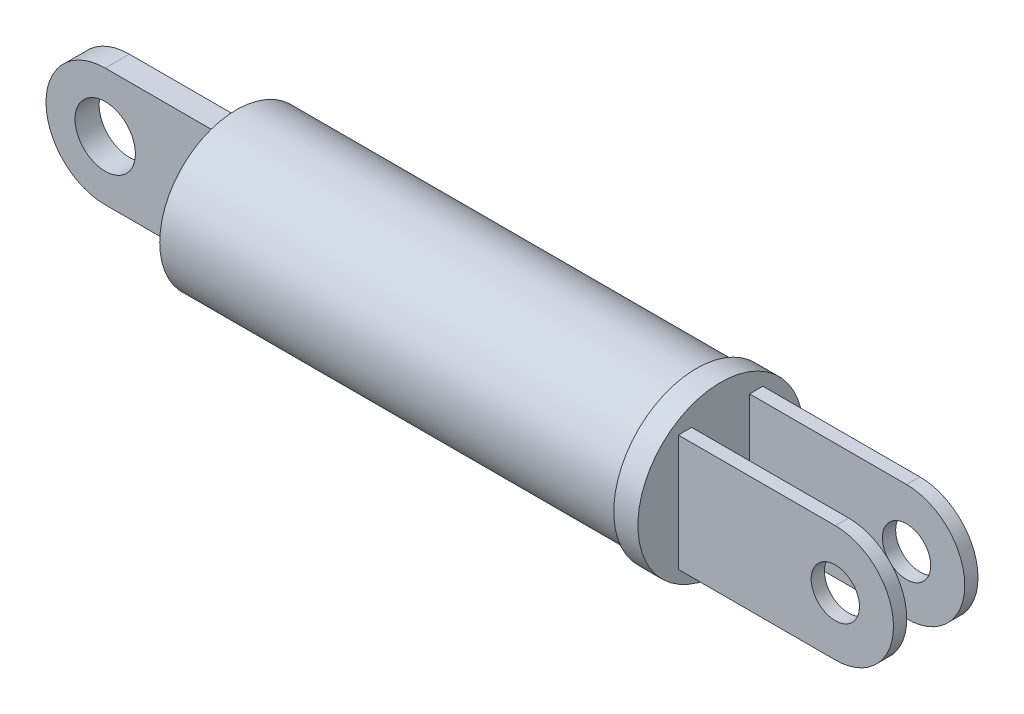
from build123d import *

# Parameters (mm, degrees)
SKETCH1_R               = 12.7
EXTRUDE1_DEPTH          = 76.2
SKETCH2_R               = 5
EXTRUDE2_DEPTH          = 2
SKETCH3_R               = 13.7
EXTRUDE3_DEPTH          = 4
SKETCH4_R               = 4
EXTRUDE4_DEPTH          = 7
CUT_EXTRUDE1_DEPTH      = 118.44480244
CUT_EXTRUDE1_DEPTH_BACK = 118.44480244
SKETCH5_W               = 279.527972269
SKETCH5_H               = 9.602426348


with BuildPart() as part:
    # Sketch1 → Extrude1 (new body)
    with BuildSketch(Plane(origin=(0, 0, 0), x_dir=(0, 0, -1), z_dir=(1, 0, 0))):
        with Locations(Location((0, 0, 0), (0, 0, 180))):
            Circle(SKETCH1_R)
    extrude(amount=EXTRUDE1_DEPTH)

    # Sketch2 → Extrude2 (add, symmetric)
    with BuildSketch(Plane.XY):
        with BuildLine():
            Line((0, 9.805687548), (-19.733094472, 9.805687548))
            ThreePointArc((-19.733094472, 9.805687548), (-29.53878202, 0), (-19.733094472, -9.805687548))
            Line((-19.733094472, -9.805687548), (0, -9.805687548))
            Line((0, -9.805687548), (0, 9.805687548))
        make_face()
        with Locations((-19.733094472, 0)):
            Circle(SKETCH2_R, mode=Mode.SUBTRACT)
    extrude(amount=EXTRUDE2_DEPTH, both=True)

    # Sketch3 → Extrude3 (add)
    with BuildSketch(Plane(origin=(76.2, 0, 0), x_dir=(0, 0, -1), z_dir=(1, 0, 0))):
        Circle(SKETCH3_R)
    extrude(amount=EXTRUDE3_DEPTH)

    # Sketch4 → Extrude4 (add, symmetric)
    with BuildSketch(Plane.XY):
        with BuildLine():
            Line((80.2, 9.635666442), (106.2, 9.635666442))
            ThreePointArc((106.2, 9.635666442), (115.835666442, 0), (106.2, -9.635666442))
            Line((106.2, -9.635666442), (80.2, -9.635666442))
            Line((80.2, -9.635666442), (80.2, 9.635666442))
        make_face()
        with Locations((106.2, 0)):
            Circle(SKETCH4_R, mode=Mode.SUBTRACT)
    extrude(amount=EXTRUDE4_DEPTH, both=True)

    # Sketch5 → Cut-Extrude1 (cut, two sides: drawn at the far end of the back side and taken through both)
    with BuildSketch(Plane(origin=(0, 0, 0), x_dir=(1, 0, 0), z_dir=(0, 1, 0)).offset(-CUT_EXTRUDE1_DEPTH_BACK)):
        with Locations((219.963986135, 0)):
            Rectangle(SKETCH5_W, SKETCH5_H)
    extrude(amount=CUT_EXTRUDE1_DEPTH + CUT_EXTRUDE1_DEPTH_BACK, mode=Mode.SUBTRACT)


solid = part.part
